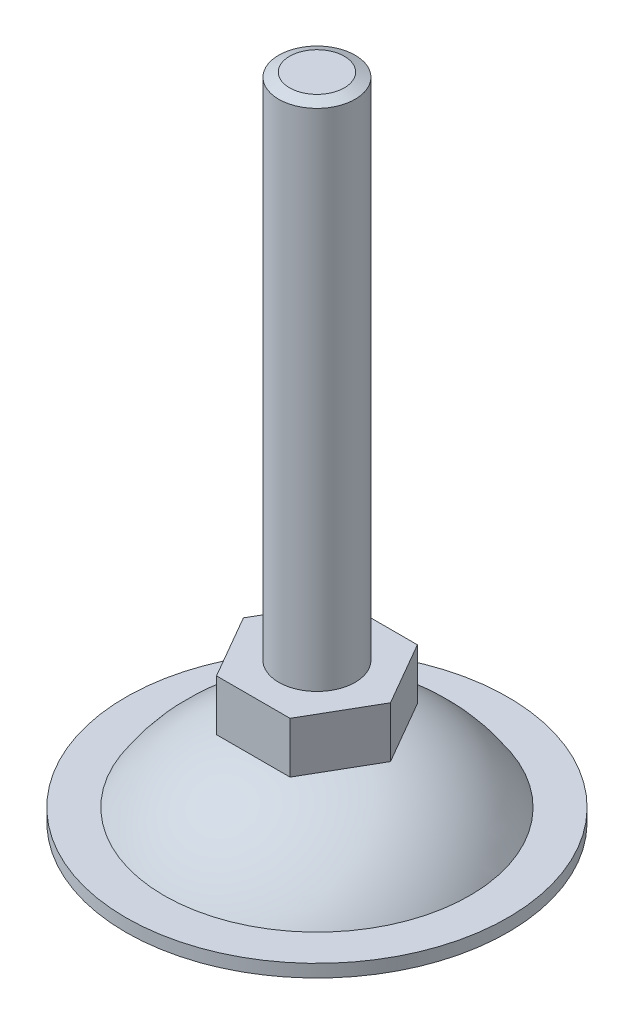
from build123d import *

# Parameters (mm, degrees)
EXTRUDE_1_DEPTH = 4


with BuildPart() as part:
    # Sketch 1 → Revolve 1 (revolve)
    with BuildSketch(Plane(origin=(0, 0, 0), x_dir=(0, 0, -1), z_dir=(1, 0, 0)), mode=Mode.PRIVATE) as revolve_1_sk:
        with BuildLine():
            Line((0, 51), (0, 0))
            Line((0, 0), (15, 0))
            Line((15, 0), (15, 1))
            Line((15, 1), (12, 1))
            ThreePointArc((12, 1), (8.146347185, 4.936825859), (3, 6.902620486))
            Line((3, 6.902620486), (3, 50.65))
            Line((3, 50.65), (2.15, 51))
            Line((2.15, 51), (0, 51))
        make_face()
    revolve(revolve_1_sk.sketch.rotate(Axis((0, 51, 0), (0, -1, 0)), 180), axis=Axis((0, 51, 0), (0, -1, 0)))

    # Sketch 2 → Extrude 1 (add)
    with BuildSketch(Plane.XZ.offset(-7)):
        Polygon((2.886751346, -5), (5.773502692, 0), (2.886751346, 5), (-2.886751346, 5), (-5.773502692, 0), (-2.886751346, -5), align=None)
    extrude(amount=-EXTRUDE_1_DEPTH)


solid = part.part
